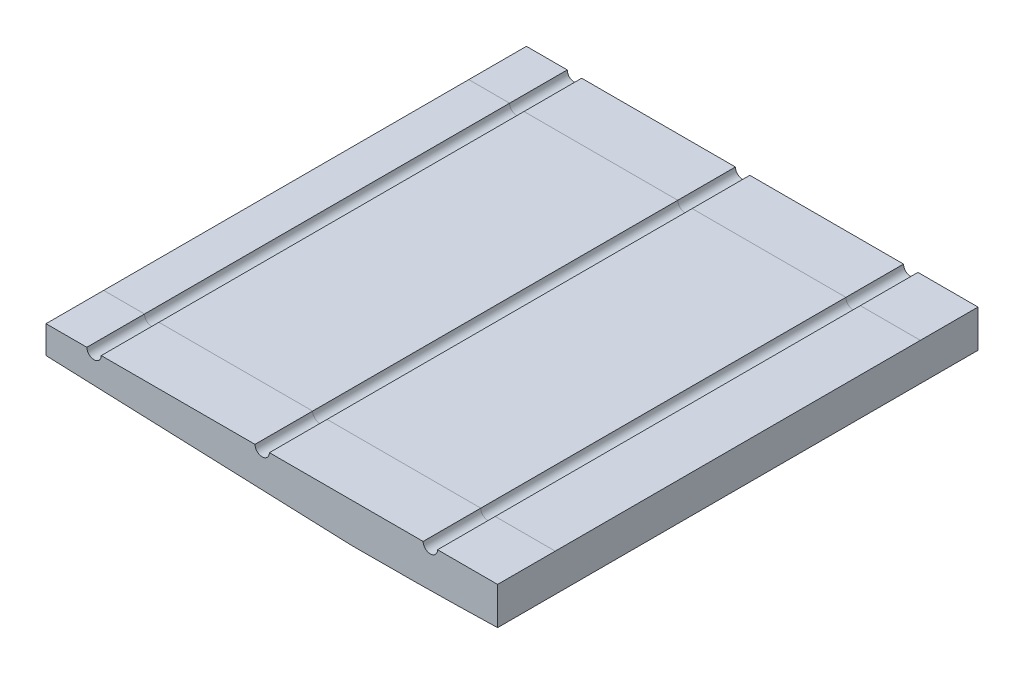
from build123d import *

# Parameters (mm, degrees)
BOSS_EXTRUDE1_DEPTH     = 100
CUT_EXTRUDE1_DEPTH      = 138.364706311
CUT_EXTRUDE1_DEPTH_BACK = 138.364706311
SKETCH3_R               = 1.5


with BuildPart() as part:
    # Sketch2 → Boss-Extrude1 (new body)
    with BuildSketch(Plane.XY):
        with BuildLine():
            Line((94, 5.75), (94, -2.052574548))
            add(Edge.make_bspline(
                [(76.967192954, -2.370571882), (82.644031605, -2.265723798), (88.325325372, -2.264437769), (94, -2.052574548)],
                knots=[0.590927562, 0.590927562, 0.590927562, 0.590927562, 0.626803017, 0.626803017, 0.626803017, 0.626803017], degree=3))
            Line((76.967192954, -2.370571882), (63.610846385, -2.420273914))
            Line((63.610846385, -2.420273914), (0, 0))
            Line((0, 0), (0, 5.75))
            Line((0, 5.75), (94, 5.75))
        make_face()
    extrude(amount=BOSS_EXTRUDE1_DEPTH)

    # Sketch3 → Cut-Extrude1 (cut, two sides: drawn at the far end of the back side and taken through both)
    with BuildSketch(Plane.XY.offset(100).offset(-CUT_EXTRUDE1_DEPTH_BACK)):
        with Locations((10, 5.75)):
            Circle(SKETCH3_R)
        with Locations((45, 5.75)):
            Circle(SKETCH3_R)
        with Locations((80, 5.75)):
            Circle(SKETCH3_R)
    extrude(amount=CUT_EXTRUDE1_DEPTH + CUT_EXTRUDE1_DEPTH_BACK, mode=Mode.SUBTRACT)


solid = part.part
